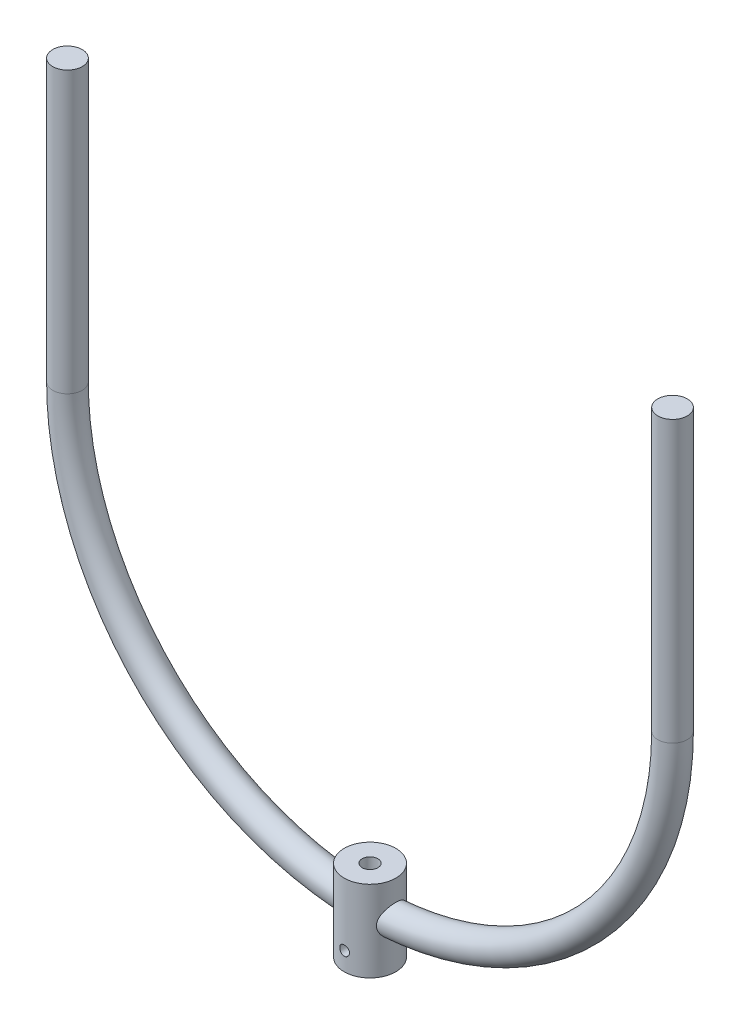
from build123d import *

# Parameters (mm, degrees)
SKETCH1_R                    = 12.7
SKETCH2_W                    = 546.1
SKETCH2_H                    = 273.05
CUT_EXTRUDE1_DEPTH           = 25.4
SKETCH3_R                    = 12.7
BOSS_EXTRUDE1_DEPTH          = 241.3
SKETCH4_R                    = 22.225
BOSS_EXTRUDE2_DEPTH          = 69.85
F_1_2_CLEARANCE_HOLE1_D      = 13.49248
F_5_16_CLEARANCE_HOLE1_D     = 8.4328
F_5_16_CLEARANCE_HOLE1_DEPTH = 12.7
F_5_16_CLEARANCE_HOLE1_TIP   = 2.533468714
SKETCH8_R                    = 12.7
CUT_EXTRUDE2_DEPTH           = 44.196


with BuildPart() as part:
    # Sketch1 → Revolve1 (revolve)
    with BuildSketch(Plane(origin=(0, 0, 0), x_dir=(1, 0, 0), z_dir=(0, 1, 0))):
        with Locations((-260.35, 0)):
            Circle(SKETCH1_R)
    revolve(axis=Axis((0, 0, -88.99), (0, 0, 1)))

    # Sketch2 → Cut-Extrude1 (cut, symmetric)
    with BuildSketch(Plane.XY):
        with Locations((0, 136.525)):
            Rectangle(SKETCH2_W, SKETCH2_H)
    extrude(amount=CUT_EXTRUDE1_DEPTH, both=True, mode=Mode.SUBTRACT)

    # Sketch3 → Boss-Extrude1 (add)
    with BuildSketch(Plane(origin=(0, 0, 0), x_dir=(1, 0, 0), z_dir=(0, 1, 0))):
        with Locations(Location((-260.35, 0, 0), (0, 0, 180))):
            Circle(SKETCH3_R)
        with Locations((260.35, 0)):
            Circle(SKETCH3_R)
    extrude(amount=BOSS_EXTRUDE1_DEPTH)

    # Sketch4 → Boss-Extrude2 (add)
    with BuildSketch(Plane(origin=(0, -298.45, 0), x_dir=(1, 0, 0), z_dir=(0, 1, 0))):
        with Locations(Location((0, 0, 0), (0, 0, 270))):
            Circle(SKETCH4_R)
    extrude(amount=BOSS_EXTRUDE2_DEPTH)

    # 1_2 Clearance Hole1 (through all)
    with Locations(Plane(origin=(0, -228.6, 0), x_dir=(1, 0, 0), z_dir=(0, 1, 0))):
        with Locations((0, 0)):
            Hole(F_1_2_CLEARANCE_HOLE1_D / 2)

    # 5_16 Clearance Hole1
    with Locations(Plane(origin=(0, -282.575, 22.225), x_dir=(1, 0, 0), z_dir=(0, 0, 1))):
        with Locations((0, 0)):
            Hole(F_5_16_CLEARANCE_HOLE1_D / 2, depth=F_5_16_CLEARANCE_HOLE1_DEPTH)
            with Locations((0, 0, -(F_5_16_CLEARANCE_HOLE1_DEPTH + F_5_16_CLEARANCE_HOLE1_TIP / 2))):  # 118° drill point
                Cone(0, F_5_16_CLEARANCE_HOLE1_D / 2, F_5_16_CLEARANCE_HOLE1_TIP, mode=Mode.SUBTRACT)

    # Sketch8 → Cut-Extrude2 (cut)
    with BuildSketch(Plane.XZ.offset(298.45)):
        with Locations(Location((0, 0, 0), (0, 0, 270))):
            Circle(SKETCH8_R)
    extrude(amount=-CUT_EXTRUDE2_DEPTH, mode=Mode.SUBTRACT)


solid = part.part
